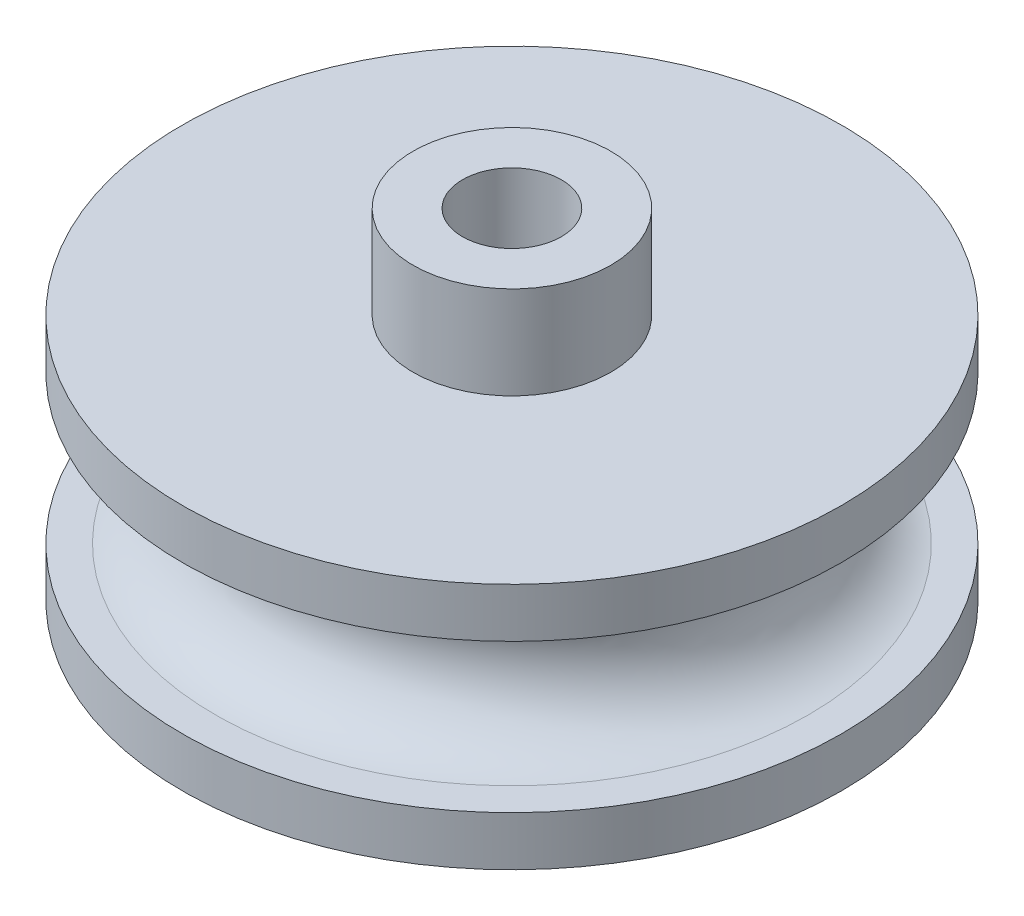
ISO-10303-21;
HEADER;
FILE_DESCRIPTION(('STEP AP214'),'2;1');
FILE_NAME('part.step','',(''),(''),'','','');
FILE_SCHEMA(('AUTOMOTIVE_DESIGN { 1 0 10303 214 1 1 1 1 }'));
ENDSEC;
DATA;
#1=APPLICATION_CONTEXT('core data for automotive mechanical design processes');
#2=APPLICATION_PROTOCOL_DEFINITION('international standard','automotive_design',2000,#1);
#3=PRODUCT_CONTEXT('',#1,'mechanical');
#4=PRODUCT('Part','Part','',(#3));
#5=PRODUCT_RELATED_PRODUCT_CATEGORY('part','',(#4));
#6=PRODUCT_DEFINITION_FORMATION('','',#4);
#7=PRODUCT_DEFINITION_CONTEXT('part definition',#1,'design');
#8=PRODUCT_DEFINITION('design','',#6,#7);
#9=PRODUCT_DEFINITION_SHAPE('','',#8);
#10=(LENGTH_UNIT() NAMED_UNIT(*) SI_UNIT(.MILLI.,.METRE.));
#11=(NAMED_UNIT(*) PLANE_ANGLE_UNIT() SI_UNIT($,.RADIAN.));
#12=(NAMED_UNIT(*) SI_UNIT($,.STERADIAN.) SOLID_ANGLE_UNIT());
#13=UNCERTAINTY_MEASURE_WITH_UNIT(LENGTH_MEASURE(1.E-05),#10,'distance_accuracy_value','');
#14=(GEOMETRIC_REPRESENTATION_CONTEXT(3) GLOBAL_UNCERTAINTY_ASSIGNED_CONTEXT((#13)) GLOBAL_UNIT_ASSIGNED_CONTEXT((#10,
#11,#12)) REPRESENTATION_CONTEXT('',''));
#15=CARTESIAN_POINT('',(0.,0.,0.));
#16=DIRECTION('',(0.,0.,1.));
#17=DIRECTION('',(1.,0.,0.));
#18=AXIS2_PLACEMENT_3D('',#15,#16,#17);
#19=CARTESIAN_POINT('',(0.,10.3125,0.));
#20=DIRECTION('',(0.,-1.,0.));
#21=DIRECTION('',(1.,0.,0.));
#22=AXIS2_PLACEMENT_3D('',#19,#20,#21);
#23=CYLINDRICAL_SURFACE('',#22,3.);
#24=CARTESIAN_POINT('',(0.,13.125,0.));
#25=DIRECTION('',(0.,-1.,0.));
#26=DIRECTION('',(1.,0.,0.));
#27=AXIS2_PLACEMENT_3D('',#24,#25,#26);
#28=CIRCLE('',#27,3.);
#29=CARTESIAN_POINT('',(3.,13.125,0.));
#30=VERTEX_POINT('',#29);
#31=EDGE_CURVE('E56',#30,#30,#28,.T.);
#32=ORIENTED_EDGE('',*,*,#31,.F.);
#33=EDGE_LOOP('',(#32));
#34=FACE_BOUND('',#33,.T.);
#35=CARTESIAN_POINT('',(0.,-13.125,0.));
#36=DIRECTION('',(0.,-1.,0.));
#37=DIRECTION('',(1.,0.,0.));
#38=AXIS2_PLACEMENT_3D('',#35,#36,#37);
#39=CIRCLE('',#38,3.);
#40=CARTESIAN_POINT('',(2.99999999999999,-13.125,0.));
#41=VERTEX_POINT('',#40);
#42=EDGE_CURVE('E18',#41,#41,#39,.F.);
#43=ORIENTED_EDGE('',*,*,#42,.F.);
#44=EDGE_LOOP('',(#43));
#45=FACE_BOUND('',#44,.T.);
#46=ADVANCED_FACE('F14',(#34,#45),#23,.F.);
#47=CARTESIAN_POINT('',(4.5,-13.125,0.));
#48=DIRECTION('',(0.,-1.,0.));
#49=DIRECTION('',(0.,0.,-1.));
#50=AXIS2_PLACEMENT_3D('',#47,#48,#49);
#51=PLANE('',#50);
#52=ORIENTED_EDGE('',*,*,#42,.T.);
#53=EDGE_LOOP('',(#52));
#54=FACE_BOUND('',#53,.T.);
#55=CARTESIAN_POINT('',(0.,-13.125,0.));
#56=DIRECTION('',(0.,-1.,0.));
#57=DIRECTION('',(1.,0.,0.));
#58=AXIS2_PLACEMENT_3D('',#55,#56,#57);
#59=CIRCLE('',#58,6.);
#60=CARTESIAN_POINT('',(6.,-13.125,0.));
#61=VERTEX_POINT('',#60);
#62=EDGE_CURVE('E54',#61,#61,#59,.F.);
#63=ORIENTED_EDGE('',*,*,#62,.F.);
#64=EDGE_LOOP('',(#63));
#65=FACE_BOUND('',#64,.T.);
#66=ADVANCED_FACE('F63',(#54,#65),#51,.T.);
#67=CARTESIAN_POINT('',(4.5,13.125,0.));
#68=DIRECTION('',(0.,1.,0.));
#69=DIRECTION('',(0.,0.,1.));
#70=AXIS2_PLACEMENT_3D('',#67,#68,#69);
#71=PLANE('',#70);
#72=ORIENTED_EDGE('',*,*,#31,.T.);
#73=EDGE_LOOP('',(#72));
#74=FACE_BOUND('',#73,.T.);
#75=CARTESIAN_POINT('',(0.,13.125,0.));
#76=DIRECTION('',(0.,-1.,0.));
#77=DIRECTION('',(1.,0.,0.));
#78=AXIS2_PLACEMENT_3D('',#75,#76,#77);
#79=CIRCLE('',#78,6.);
#80=CARTESIAN_POINT('',(6.,13.125,0.));
#81=VERTEX_POINT('',#80);
#82=EDGE_CURVE('E51',#81,#81,#79,.T.);
#83=ORIENTED_EDGE('',*,*,#82,.F.);
#84=EDGE_LOOP('',(#83));
#85=FACE_BOUND('',#84,.T.);
#86=ADVANCED_FACE('F72',(#74,#85),#71,.T.);
#87=CARTESIAN_POINT('',(0.,-10.3125,0.));
#88=DIRECTION('',(0.,-1.,0.));
#89=DIRECTION('',(1.,0.,0.));
#90=AXIS2_PLACEMENT_3D('',#87,#88,#89);
#91=CYLINDRICAL_SURFACE('',#90,6.);
#92=CARTESIAN_POINT('',(0.,-7.49999999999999,0.));
#93=DIRECTION('',(0.,-1.,0.));
#94=DIRECTION('',(1.,0.,0.));
#95=AXIS2_PLACEMENT_3D('',#92,#93,#94);
#96=CIRCLE('',#95,6.);
#97=CARTESIAN_POINT('',(6.,-7.5,0.));
#98=VERTEX_POINT('',#97);
#99=EDGE_CURVE('E48',#98,#98,#96,.F.);
#100=ORIENTED_EDGE('',*,*,#99,.F.);
#101=EDGE_LOOP('',(#100));
#102=FACE_BOUND('',#101,.T.);
#103=ORIENTED_EDGE('',*,*,#62,.T.);
#104=EDGE_LOOP('',(#103));
#105=FACE_BOUND('',#104,.T.);
#106=ADVANCED_FACE('F108',(#102,#105),#91,.T.);
#107=CARTESIAN_POINT('',(0.,10.3125,0.));
#108=DIRECTION('',(0.,-1.,0.));
#109=DIRECTION('',(1.,0.,0.));
#110=AXIS2_PLACEMENT_3D('',#107,#108,#109);
#111=CYLINDRICAL_SURFACE('',#110,6.);
#112=ORIENTED_EDGE('',*,*,#82,.T.);
#113=EDGE_LOOP('',(#112));
#114=FACE_BOUND('',#113,.T.);
#115=CARTESIAN_POINT('',(0.,7.5,0.));
#116=DIRECTION('',(0.,-1.,0.));
#117=DIRECTION('',(1.,0.,0.));
#118=AXIS2_PLACEMENT_3D('',#115,#116,#117);
#119=CIRCLE('',#118,6.);
#120=CARTESIAN_POINT('',(6.,7.5,0.));
#121=VERTEX_POINT('',#120);
#122=EDGE_CURVE('E45',#121,#121,#119,.T.);
#123=ORIENTED_EDGE('',*,*,#122,.F.);
#124=EDGE_LOOP('',(#123));
#125=FACE_BOUND('',#124,.T.);
#126=ADVANCED_FACE('F100',(#114,#125),#111,.T.);
#127=CARTESIAN_POINT('',(13.,-7.5,0.));
#128=DIRECTION('',(0.,-1.,0.));
#129=DIRECTION('',(0.,0.,-1.));
#130=AXIS2_PLACEMENT_3D('',#127,#128,#129);
#131=PLANE('',#130);
#132=ORIENTED_EDGE('',*,*,#99,.T.);
#133=EDGE_LOOP('',(#132));
#134=FACE_BOUND('',#133,.T.);
#135=CARTESIAN_POINT('',(0.,-7.49999999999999,0.));
#136=DIRECTION('',(0.,-1.,0.));
#137=DIRECTION('',(1.,0.,0.));
#138=AXIS2_PLACEMENT_3D('',#135,#136,#137);
#139=CIRCLE('',#138,20.);
#140=CARTESIAN_POINT('',(20.,-7.5,0.));
#141=VERTEX_POINT('',#140);
#142=EDGE_CURVE('E41',#141,#141,#139,.F.);
#143=ORIENTED_EDGE('',*,*,#142,.F.);
#144=EDGE_LOOP('',(#143));
#145=FACE_BOUND('',#144,.T.);
#146=ADVANCED_FACE('F99',(#134,#145),#131,.T.);
#147=CARTESIAN_POINT('',(13.,7.5,0.));
#148=DIRECTION('',(0.,1.,0.));
#149=DIRECTION('',(0.,0.,1.));
#150=AXIS2_PLACEMENT_3D('',#147,#148,#149);
#151=PLANE('',#150);
#152=ORIENTED_EDGE('',*,*,#122,.T.);
#153=EDGE_LOOP('',(#152));
#154=FACE_BOUND('',#153,.T.);
#155=CARTESIAN_POINT('',(0.,7.50000000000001,0.));
#156=DIRECTION('',(0.,-1.,0.));
#157=DIRECTION('',(1.,0.,0.));
#158=AXIS2_PLACEMENT_3D('',#155,#156,#157);
#159=CIRCLE('',#158,20.);
#160=CARTESIAN_POINT('',(20.,7.5,0.));
#161=VERTEX_POINT('',#160);
#162=EDGE_CURVE('E38',#161,#161,#159,.T.);
#163=ORIENTED_EDGE('',*,*,#162,.F.);
#164=EDGE_LOOP('',(#163));
#165=FACE_BOUND('',#164,.T.);
#166=ADVANCED_FACE('F95',(#154,#165),#151,.T.);
#167=CARTESIAN_POINT('',(0.,-5.99999999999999,0.));
#168=DIRECTION('',(0.,-1.,0.));
#169=DIRECTION('',(1.,0.,0.));
#170=AXIS2_PLACEMENT_3D('',#167,#168,#169);
#171=CYLINDRICAL_SURFACE('',#170,20.);
#172=CARTESIAN_POINT('',(0.,-4.49999999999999,0.));
#173=DIRECTION('',(0.,-1.,0.));
#174=DIRECTION('',(1.,0.,0.));
#175=AXIS2_PLACEMENT_3D('',#172,#173,#174);
#176=CIRCLE('',#175,20.);
#177=CARTESIAN_POINT('',(20.,-4.5,0.));
#178=VERTEX_POINT('',#177);
#179=EDGE_CURVE('E34',#178,#178,#176,.F.);
#180=ORIENTED_EDGE('',*,*,#179,.F.);
#181=EDGE_LOOP('',(#180));
#182=FACE_BOUND('',#181,.T.);
#183=ORIENTED_EDGE('',*,*,#142,.T.);
#184=EDGE_LOOP('',(#183));
#185=FACE_BOUND('',#184,.T.);
#186=ADVANCED_FACE('F92',(#182,#185),#171,.T.);
#187=CARTESIAN_POINT('',(0.,6.00000000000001,0.));
#188=DIRECTION('',(0.,-1.,0.));
#189=DIRECTION('',(1.,0.,0.));
#190=AXIS2_PLACEMENT_3D('',#187,#188,#189);
#191=CYLINDRICAL_SURFACE('',#190,20.);
#192=ORIENTED_EDGE('',*,*,#162,.T.);
#193=EDGE_LOOP('',(#192));
#194=FACE_BOUND('',#193,.T.);
#195=CARTESIAN_POINT('',(0.,4.50000000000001,0.));
#196=DIRECTION('',(0.,-1.,0.));
#197=DIRECTION('',(1.,0.,0.));
#198=AXIS2_PLACEMENT_3D('',#195,#196,#197);
#199=CIRCLE('',#198,20.);
#200=CARTESIAN_POINT('',(20.,4.5,0.));
#201=VERTEX_POINT('',#200);
#202=EDGE_CURVE('E28',#201,#201,#199,.T.);
#203=ORIENTED_EDGE('',*,*,#202,.F.);
#204=EDGE_LOOP('',(#203));
#205=FACE_BOUND('',#204,.T.);
#206=ADVANCED_FACE('F88',(#194,#205),#191,.T.);
#207=CARTESIAN_POINT('',(19.,-4.5,0.));
#208=DIRECTION('',(0.,1.,0.));
#209=DIRECTION('',(0.,0.,1.));
#210=AXIS2_PLACEMENT_3D('',#207,#208,#209);
#211=PLANE('',#210);
#212=CARTESIAN_POINT('',(0.,-4.5,0.));
#213=DIRECTION('',(0.,-1.,0.));
#214=DIRECTION('',(1.,0.,0.));
#215=AXIS2_PLACEMENT_3D('',#212,#213,#214);
#216=CIRCLE('',#215,18.);
#217=CARTESIAN_POINT('',(18.,-4.5,0.));
#218=VERTEX_POINT('',#217);
#219=EDGE_CURVE('E22',#218,#218,#216,.F.);
#220=ORIENTED_EDGE('',*,*,#219,.F.);
#221=EDGE_LOOP('',(#220));
#222=FACE_BOUND('',#221,.T.);
#223=ORIENTED_EDGE('',*,*,#179,.T.);
#224=EDGE_LOOP('',(#223));
#225=FACE_BOUND('',#224,.T.);
#226=ADVANCED_FACE('F80',(#222,#225),#211,.T.);
#227=CARTESIAN_POINT('',(19.,4.5,0.));
#228=DIRECTION('',(0.,-1.,0.));
#229=DIRECTION('',(0.,0.,-1.));
#230=AXIS2_PLACEMENT_3D('',#227,#228,#229);
#231=PLANE('',#230);
#232=CARTESIAN_POINT('',(0.,4.50000000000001,0.));
#233=DIRECTION('',(0.,-1.,0.));
#234=DIRECTION('',(1.,0.,0.));
#235=AXIS2_PLACEMENT_3D('',#232,#233,#234);
#236=CIRCLE('',#235,18.);
#237=CARTESIAN_POINT('',(18.,4.50000000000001,0.));
#238=VERTEX_POINT('',#237);
#239=EDGE_CURVE('E10',#238,#238,#236,.T.);
#240=ORIENTED_EDGE('',*,*,#239,.F.);
#241=EDGE_LOOP('',(#240));
#242=FACE_BOUND('',#241,.T.);
#243=ORIENTED_EDGE('',*,*,#202,.T.);
#244=EDGE_LOOP('',(#243));
#245=FACE_BOUND('',#244,.T.);
#246=ADVANCED_FACE('F75',(#242,#245),#231,.T.);
#247=CARTESIAN_POINT('',(0.,0.,0.));
#248=DIRECTION('',(0.,-1.,0.));
#249=DIRECTION('',(1.,0.,0.));
#250=AXIS2_PLACEMENT_3D('',#247,#248,#249);
#251=TOROIDAL_SURFACE('',#250,18.6754032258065,4.55040322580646);
#252=ORIENTED_EDGE('',*,*,#239,.T.);
#253=EDGE_LOOP('',(#252));
#254=FACE_BOUND('',#253,.T.);
#255=ORIENTED_EDGE('',*,*,#219,.T.);
#256=EDGE_LOOP('',(#255));
#257=FACE_BOUND('',#256,.T.);
#258=ADVANCED_FACE('F16',(#254,#257),#251,.F.);
#259=CLOSED_SHELL('',(#46,#66,#86,#106,#126,#146,#166,#186,#206,#226,#246,#258));
#260=MANIFOLD_SOLID_BREP('B1',#259);
#261=ADVANCED_BREP_SHAPE_REPRESENTATION('',(#18,#260),#14);
#262=SHAPE_DEFINITION_REPRESENTATION(#9,#261);
ENDSEC;
END-ISO-10303-21;
